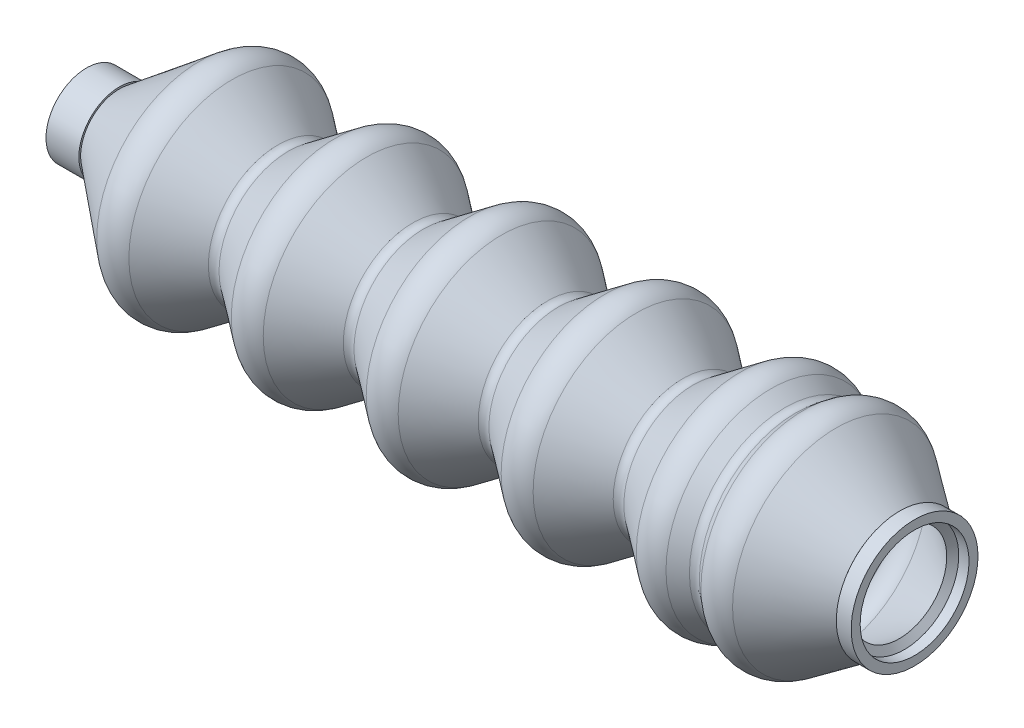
from build123d import *

# Parameters (mm, degrees)
COQUE4_T = 1


with BuildPart() as part:
    # Esquisse2 → Base-R_volution (revolve)
    with BuildSketch(Plane.XY, mode=Mode.PRIVATE) as base_r_volution_sk:
        with BuildLine():
            Line((235.109775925, 42.695586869), (235.109775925, 39.193221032))
            Line((235.109775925, 39.193221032), (237.763083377, 39.193221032))
            Line((237.763083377, 39.193221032), (237.763083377, 40.466808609))
            Line((237.763083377, 40.466808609), (248.263367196, 32.083101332))
            ThreePointArc((248.263367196, 32.083101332), (249.471075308, 31.646441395), (250.695350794, 32.034230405))
            Line((250.695350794, 32.034230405), (255.788935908, 35.776166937))
            ThreePointArc((255.788935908, 35.776166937), (256.973029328, 36.164359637), (258.157122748, 35.776166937))
            Line((258.157122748, 35.776166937), (263.288935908, 32.006146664))
            ThreePointArc((263.288935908, 32.006146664), (264.473029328, 31.617953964), (265.657122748, 32.006146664))
            Line((265.657122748, 32.006146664), (270.788935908, 35.776166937))
            ThreePointArc((270.788935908, 35.776166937), (271.973029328, 36.164359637), (273.157122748, 35.776166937))
            Line((273.157122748, 35.776166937), (278.288935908, 32.006146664))
            ThreePointArc((278.288935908, 32.006146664), (279.473029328, 31.617953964), (280.657122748, 32.006146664))
            Line((280.657122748, 32.006146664), (285.788935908, 35.776166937))
            ThreePointArc((285.788935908, 35.776166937), (286.973029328, 36.164359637), (288.157122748, 35.776166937))
            Line((288.157122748, 35.776166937), (293.288935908, 32.006146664))
            ThreePointArc((293.288935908, 32.006146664), (294.473029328, 31.617953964), (295.657122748, 32.006146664))
            Line((295.657122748, 32.006146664), (300.788935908, 35.776166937))
            ThreePointArc((300.788935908, 35.776166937), (301.973029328, 36.164359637), (303.157122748, 35.776166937))
            Line((303.157122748, 35.776166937), (308.375196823, 31.942776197))
            ThreePointArc((308.375196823, 31.942776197), (309.4984537, 31.555508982), (310.643181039, 31.873756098))
            Line((310.643181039, 31.873756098), (312.22592422, 32.894396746))
            ThreePointArc((312.22592422, 32.894396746), (313.411761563, 33.210969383), (314.559205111, 32.775306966))
            Line((314.559205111, 32.775306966), (315.439893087, 32.070756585))
            ThreePointArc((315.439893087, 32.070756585), (316.633501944, 31.633272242), (317.849647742, 32.00352088))
            Line((317.849647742, 32.00352088), (325.46172198, 37.425820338))
            Line((325.46172198, 37.425820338), (326.01717776, 36.646045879))
            Line((326.01717776, 36.646045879), (327.155555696, 36.646045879))
            Line((327.155555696, 36.646045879), (327.155555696, 42.695586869))
            Line((327.155555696, 42.695586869), (235.109775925, 42.695586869))
        make_face()
    revolve(base_r_volution_sk.sketch.rotate(Axis((235.109775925, 42.695586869, 0), (1, 0, 0)), 270), axis=Axis((235.109775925, 42.695586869, 0), (1, 0, 0)))

    # Coque4
    coque4_openings = [part.faces().sort_by_distance(p)[0] for p in [
        (235.109775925, 42.695586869, 0),
        (327.155555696, 42.695586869, 0),
    ]]
    offset(amount=COQUE4_T, openings=coque4_openings, kind=Kind.INTERSECTION)


solid = part.part
